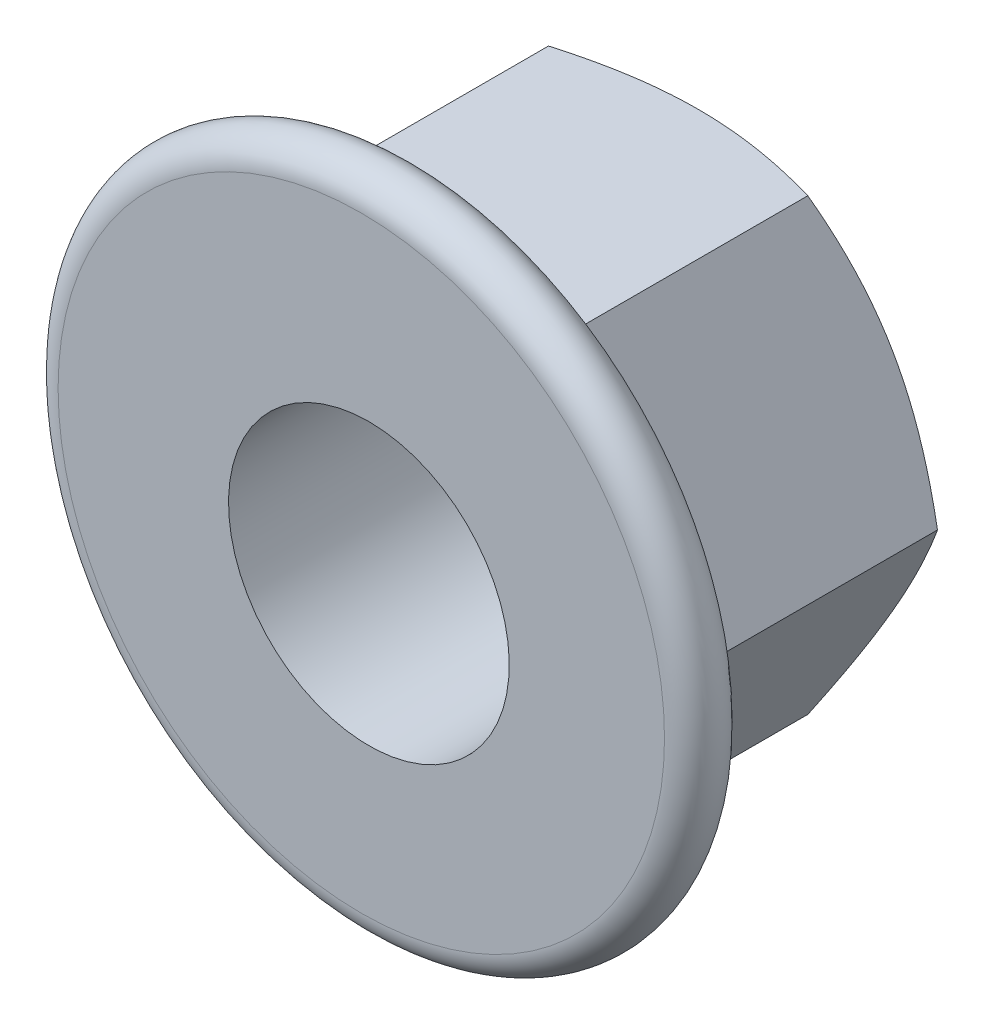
ISO-10303-21;
HEADER;
FILE_DESCRIPTION(('STEP AP214'),'2;1');
FILE_NAME('part.step','',(''),(''),'','','');
FILE_SCHEMA(('AUTOMOTIVE_DESIGN { 1 0 10303 214 1 1 1 1 }'));
ENDSEC;
DATA;
#1=APPLICATION_CONTEXT('core data for automotive mechanical design processes');
#2=APPLICATION_PROTOCOL_DEFINITION('international standard','automotive_design',2000,#1);
#3=PRODUCT_CONTEXT('',#1,'mechanical');
#4=PRODUCT('Part','Part','',(#3));
#5=PRODUCT_RELATED_PRODUCT_CATEGORY('part','',(#4));
#6=PRODUCT_DEFINITION_FORMATION('','',#4);
#7=PRODUCT_DEFINITION_CONTEXT('part definition',#1,'design');
#8=PRODUCT_DEFINITION('design','',#6,#7);
#9=PRODUCT_DEFINITION_SHAPE('','',#8);
#10=(LENGTH_UNIT() NAMED_UNIT(*) SI_UNIT(.MILLI.,.METRE.));
#11=(NAMED_UNIT(*) PLANE_ANGLE_UNIT() SI_UNIT($,.RADIAN.));
#12=(NAMED_UNIT(*) SI_UNIT($,.STERADIAN.) SOLID_ANGLE_UNIT());
#13=UNCERTAINTY_MEASURE_WITH_UNIT(LENGTH_MEASURE(1.E-05),#10,'distance_accuracy_value','');
#14=(GEOMETRIC_REPRESENTATION_CONTEXT(3) GLOBAL_UNCERTAINTY_ASSIGNED_CONTEXT((#13)) GLOBAL_UNIT_ASSIGNED_CONTEXT((#10,
#11,#12)) REPRESENTATION_CONTEXT('',''));
#15=CARTESIAN_POINT('',(0.,0.,0.));
#16=DIRECTION('',(0.,0.,1.));
#17=DIRECTION('',(1.,0.,0.));
#18=AXIS2_PLACEMENT_3D('',#15,#16,#17);
#19=CARTESIAN_POINT('',(0.,0.,-1.));
#20=DIRECTION('',(0.,0.,1.));
#21=DIRECTION('',(1.,0.,0.));
#22=AXIS2_PLACEMENT_3D('',#19,#20,#21);
#23=PLANE('',#22);
#24=CARTESIAN_POINT('',(32.1347700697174,-0.248725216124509,-0.999999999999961));
#25=DIRECTION('',(0.,0.,-1.));
#26=DIRECTION('',(0.,1.,0.));
#27=AXIS2_PLACEMENT_3D('',#24,#25,#26);
#28=CIRCLE('',#27,2.5);
#29=CARTESIAN_POINT('',(32.1347700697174,2.25127478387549,-0.999999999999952));
#30=VERTEX_POINT('',#29);
#31=EDGE_CURVE('E104',#30,#30,#28,.T.);
#32=ORIENTED_EDGE('',*,*,#31,.T.);
#33=EDGE_LOOP('',(#32));
#34=FACE_BOUND('',#33,.T.);
#35=CARTESIAN_POINT('',(32.,0.,-1.));
#36=DIRECTION('',(0.,0.,-1.));
#37=DIRECTION('',(0.,1.,0.));
#38=AXIS2_PLACEMENT_3D('',#35,#36,#37);
#39=CIRCLE('',#38,5.4);
#40=CARTESIAN_POINT('',(32.,5.4,-0.999999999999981));
#41=VERTEX_POINT('',#40);
#42=EDGE_CURVE('E9',#41,#41,#39,.T.);
#43=ORIENTED_EDGE('',*,*,#42,.F.);
#44=EDGE_LOOP('',(#43));
#45=FACE_BOUND('',#44,.T.);
#46=ADVANCED_FACE('F14',(#34,#45),#23,.T.);
#47=CARTESIAN_POINT('',(0.,0.,-7.));
#48=DIRECTION('',(0.,0.,-1.));
#49=DIRECTION('',(0.,1.,0.));
#50=AXIS2_PLACEMENT_3D('',#47,#48,#49);
#51=PLANE('',#50);
#52=CARTESIAN_POINT('',(32.1347700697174,-0.248725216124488,-7.));
#53=DIRECTION('',(0.,0.,-1.));
#54=DIRECTION('',(0.,1.,0.));
#55=AXIS2_PLACEMENT_3D('',#52,#53,#54);
#56=CIRCLE('',#55,2.5);
#57=CARTESIAN_POINT('',(32.1347700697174,2.25127478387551,-6.99999999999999));
#58=VERTEX_POINT('',#57);
#59=EDGE_CURVE('E258',#58,#58,#56,.T.);
#60=ORIENTED_EDGE('',*,*,#59,.F.);
#61=EDGE_LOOP('',(#60));
#62=FACE_BOUND('',#61,.T.);
#63=CARTESIAN_POINT('',(32.,0.,-7.));
#64=DIRECTION('',(0.,0.,-1.));
#65=DIRECTION('',(0.,1.,0.));
#66=AXIS2_PLACEMENT_3D('',#63,#64,#65);
#67=CIRCLE('',#66,4.);
#68=CARTESIAN_POINT('',(32.,4.,-7.));
#69=VERTEX_POINT('',#68);
#70=CARTESIAN_POINT('',(35.4641016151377,2.00000000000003,-7.));
#71=VERTEX_POINT('',#70);
#72=EDGE_CURVE('E263',#69,#71,#67,.T.);
#73=ORIENTED_EDGE('',*,*,#72,.T.);
#74=CARTESIAN_POINT('',(35.4641016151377,-1.99999999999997,-7.));
#75=VERTEX_POINT('',#74);
#76=EDGE_CURVE('E103',#71,#75,#67,.T.);
#77=ORIENTED_EDGE('',*,*,#76,.T.);
#78=CARTESIAN_POINT('',(32.,-4.,-7.));
#79=VERTEX_POINT('',#78);
#80=EDGE_CURVE('E273',#75,#79,#67,.T.);
#81=ORIENTED_EDGE('',*,*,#80,.T.);
#82=CARTESIAN_POINT('',(28.5358983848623,-1.99999999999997,-7.));
#83=VERTEX_POINT('',#82);
#84=EDGE_CURVE('E274',#79,#83,#67,.T.);
#85=ORIENTED_EDGE('',*,*,#84,.T.);
#86=CARTESIAN_POINT('',(28.5358983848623,2.00000000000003,-7.));
#87=VERTEX_POINT('',#86);
#88=EDGE_CURVE('E272',#83,#87,#67,.T.);
#89=ORIENTED_EDGE('',*,*,#88,.T.);
#90=EDGE_CURVE('E267',#87,#69,#67,.T.);
#91=ORIENTED_EDGE('',*,*,#90,.T.);
#92=EDGE_LOOP('',(#73,#77,#81,#85,#89,#91));
#93=FACE_BOUND('',#92,.T.);
#94=ADVANCED_FACE('F16',(#62,#93),#51,.T.);
#95=CARTESIAN_POINT('',(32.,0.,-3.09067784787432));
#96=DIRECTION('',(0.,0.,1.));
#97=DIRECTION('',(0.,-1.,0.));
#98=AXIS2_PLACEMENT_3D('',#95,#96,#97);
#99=CONICAL_SURFACE('',#98,4.,0.959931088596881);
#100=CARTESIAN_POINT('',(32.,0.,-1.9095760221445));
#101=DIRECTION('',(0.,0.,-1.));
#102=DIRECTION('',(0.,1.,0.));
#103=AXIS2_PLACEMENT_3D('',#100,#101,#102);
#104=CIRCLE('',#103,5.68678821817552);
#105=CARTESIAN_POINT('',(32.,5.68678821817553,-1.90957602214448));
#106=VERTEX_POINT('',#105);
#107=EDGE_CURVE('E22',#106,#106,#104,.T.);
#108=ORIENTED_EDGE('',*,*,#107,.T.);
#109=EDGE_LOOP('',(#108));
#110=FACE_BOUND('',#109,.T.);
#111=CARTESIAN_POINT('',(36.6189176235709,0.000200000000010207,-2.65730705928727));
#112=CARTESIAN_POINT('',(36.5154795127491,-0.178960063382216,-2.72977369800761));
#113=CARTESIAN_POINT('',(36.4106910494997,-0.360459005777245,-2.79584910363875));
#114=CARTESIAN_POINT('',(36.1983983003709,-0.728160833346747,-2.91101482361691));
#115=CARTESIAN_POINT('',(36.0908850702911,-0.914379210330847,-2.96003838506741));
#116=CARTESIAN_POINT('',(35.9301314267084,-1.19281268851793,-3.01652197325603));
#117=CARTESIAN_POINT('',(35.8776295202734,-1.28374865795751,-3.03235715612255));
#118=CARTESIAN_POINT('',(35.7722894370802,-1.46620303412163,-3.05854887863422));
#119=CARTESIAN_POINT('',(35.7194513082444,-1.5577213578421,-3.06890618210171));
#120=CARTESIAN_POINT('',(35.6136681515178,-1.74094315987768,-3.08382166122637));
#121=CARTESIAN_POINT('',(35.5607235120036,-1.83264596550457,-3.0883907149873));
#122=CARTESIAN_POINT('',(35.454795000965,-2.0161195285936,-3.09163055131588));
#123=CARTESIAN_POINT('',(35.4018111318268,-2.10789028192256,-3.09030166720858));
#124=CARTESIAN_POINT('',(35.2615700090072,-2.3507950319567,-3.07899371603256));
#125=CARTESIAN_POINT('',(35.174404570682,-2.50176999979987,-3.0639567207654));
#126=CARTESIAN_POINT('',(35.0009414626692,-2.80221691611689,-3.01904410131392));
#127=CARTESIAN_POINT('',(34.9146451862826,-2.95168645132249,-2.98914763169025));
#128=CARTESIAN_POINT('',(34.7407440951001,-3.25289197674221,-2.91545230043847));
#129=CARTESIAN_POINT('',(34.6531835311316,-3.40455132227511,-2.87124563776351));
#130=CARTESIAN_POINT('',(34.4799009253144,-3.70468559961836,-2.77187228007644));
#131=CARTESIAN_POINT('',(34.3941741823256,-3.85316867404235,-2.71673863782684));
#132=CARTESIAN_POINT('',(34.3092856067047,-4.0002,-2.65730705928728));
#133=B_SPLINE_CURVE_WITH_KNOTS('',3,(#111,#112,#113,#114,#115,#116,#117,#118,#119,#120,#121,
#122,#123,#124,#125,#126,#127,#128,#129,#130,#131,#132),.UNSPECIFIED.,.F.,.F.,(4,2,2,2,2,2,2,2,
2,2,4),(0.,0.658199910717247,1.31894822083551,1.63738904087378,1.95578544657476,
2.27358258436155,2.59136176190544,3.11554881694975,3.64047330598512,4.18191284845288,
4.72173893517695),.UNSPECIFIED.);
#134=CARTESIAN_POINT('',(36.618802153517,0.,-2.65738791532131));
#135=VERTEX_POINT('',#134);
#136=CARTESIAN_POINT('',(34.3094010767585,-4.,-2.65738791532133));
#137=VERTEX_POINT('',#136);
#138=EDGE_CURVE('E29',#135,#137,#133,.T.);
#139=ORIENTED_EDGE('',*,*,#138,.F.);
#140=CARTESIAN_POINT('',(34.3092856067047,4.0002,-2.65730705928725));
#141=CARTESIAN_POINT('',(34.4127237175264,3.82103993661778,-2.72977369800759));
#142=CARTESIAN_POINT('',(34.5175121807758,3.63954099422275,-2.79584910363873));
#143=CARTESIAN_POINT('',(34.7298049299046,3.27183916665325,-2.91101482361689));
#144=CARTESIAN_POINT('',(34.8373181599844,3.08562078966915,-2.96003838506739));
#145=CARTESIAN_POINT('',(34.9980718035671,2.80718731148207,-3.01652197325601));
#146=CARTESIAN_POINT('',(35.0505737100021,2.71625134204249,-3.03235715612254));
#147=CARTESIAN_POINT('',(35.1559137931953,2.53379696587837,-3.0585488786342));
#148=CARTESIAN_POINT('',(35.2087519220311,2.4422786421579,-3.06890618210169));
#149=CARTESIAN_POINT('',(35.3145350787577,2.25905684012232,-3.08382166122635));
#150=CARTESIAN_POINT('',(35.3674797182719,2.16735403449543,-3.08839071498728));
#151=CARTESIAN_POINT('',(35.4734082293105,1.9838804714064,-3.09163055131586));
#152=CARTESIAN_POINT('',(35.5263920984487,1.89210971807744,-3.09030166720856));
#153=CARTESIAN_POINT('',(35.6666332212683,1.6492049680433,-3.07899371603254));
#154=CARTESIAN_POINT('',(35.7537986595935,1.49823000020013,-3.06395672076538));
#155=CARTESIAN_POINT('',(35.9272617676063,1.19778308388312,-3.01904410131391));
#156=CARTESIAN_POINT('',(36.0135580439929,1.04831354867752,-2.98914763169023));
#157=CARTESIAN_POINT('',(36.1874591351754,0.7471080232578,-2.91545230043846));
#158=CARTESIAN_POINT('',(36.2750196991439,0.595448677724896,-2.8712456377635));
#159=CARTESIAN_POINT('',(36.4483023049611,0.295314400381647,-2.77187228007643));
#160=CARTESIAN_POINT('',(36.5340290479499,0.14683132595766,-2.71673863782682));
#161=CARTESIAN_POINT('',(36.6189176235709,-0.000199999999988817,-2.65730705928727));
#162=B_SPLINE_CURVE_WITH_KNOTS('',3,(#140,#141,#142,#143,#144,#145,#146,#147,#148,#149,#150,
#151,#152,#153,#154,#155,#156,#157,#158,#159,#160,#161),.UNSPECIFIED.,.F.,.F.,(4,2,2,2,2,2,2,2,
2,2,4),(0.,0.658199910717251,1.31894822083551,1.63738904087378,1.95578544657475,
2.27358258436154,2.59136176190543,3.11554881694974,3.64047330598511,4.18191284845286,
4.72173893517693),.UNSPECIFIED.);
#163=CARTESIAN_POINT('',(34.3094010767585,4.,-2.6573879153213));
#164=VERTEX_POINT('',#163);
#165=EDGE_CURVE('E90',#164,#135,#162,.T.);
#166=ORIENTED_EDGE('',*,*,#165,.F.);
#167=CARTESIAN_POINT('',(24.9229745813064,4.,-0.199363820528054));
#168=CARTESIAN_POINT('',(25.0639054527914,4.,-0.285264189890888));
#169=CARTESIAN_POINT('',(25.2051070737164,4.,-0.370723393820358));
#170=CARTESIAN_POINT('',(25.488152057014,4.,-0.540584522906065));
#171=CARTESIAN_POINT('',(25.6299954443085,4.,-0.624986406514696));
#172=CARTESIAN_POINT('',(25.9145609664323,4.,-0.792638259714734));
#173=CARTESIAN_POINT('',(26.057283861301,4.,-0.875886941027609));
#174=CARTESIAN_POINT('',(26.3435787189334,4.,-1.04090944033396));
#175=CARTESIAN_POINT('',(26.4871506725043,4.,-1.12268327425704));
#176=CARTESIAN_POINT('',(26.780013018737,4.,-1.28712522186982));
#177=CARTESIAN_POINT('',(26.929336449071,4.,-1.36973461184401));
#178=CARTESIAN_POINT('',(27.2292213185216,4.,-1.53267350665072));
#179=CARTESIAN_POINT('',(27.3797827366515,4.,-1.61300305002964));
#180=CARTESIAN_POINT('',(27.6823155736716,4.,-1.77084660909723));
#181=CARTESIAN_POINT('',(27.8342865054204,4.00000000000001,-1.84836155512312));
#182=CARTESIAN_POINT('',(28.1399361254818,4.,-1.99993727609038));
#183=CARTESIAN_POINT('',(28.2936147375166,4.,-2.07399820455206));
#184=CARTESIAN_POINT('',(28.6559618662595,4.,-2.24246527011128));
#185=CARTESIAN_POINT('',(28.8654384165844,4.,-2.33515270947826));
#186=CARTESIAN_POINT('',(29.2888282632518,4.00000000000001,-2.5100609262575));
#187=CARTESIAN_POINT('',(29.5027425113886,4.00000000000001,-2.59227943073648));
#188=CARTESIAN_POINT('',(29.9333427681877,4.00000000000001,-2.74162696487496));
#189=CARTESIAN_POINT('',(30.1499759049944,4.00000000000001,-2.80890570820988));
#190=CARTESIAN_POINT('',(30.5882183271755,4.00000000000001,-2.92473143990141));
#191=CARTESIAN_POINT('',(30.8098245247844,4.,-2.97328972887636));
#192=CARTESIAN_POINT('',(31.2086707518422,4.,-3.03888798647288));
#193=CARTESIAN_POINT('',(31.3851550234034,4.00000000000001,-3.06047029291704));
#194=CARTESIAN_POINT('',(31.7393586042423,4.00000000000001,-3.08744195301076));
#195=CARTESIAN_POINT('',(31.9170776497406,4.00000000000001,-3.09283466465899));
#196=CARTESIAN_POINT('',(32.272393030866,4.00000000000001,-3.08695020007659));
#197=CARTESIAN_POINT('',(32.4499891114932,4.00000000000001,-3.07565799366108));
#198=CARTESIAN_POINT('',(32.8034666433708,4.00000000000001,-3.03735634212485));
#199=CARTESIAN_POINT('',(32.979347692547,4.,-3.01034329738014));
#200=CARTESIAN_POINT('',(33.419041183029,4.,-2.92500955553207));
#201=CARTESIAN_POINT('',(33.6810987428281,4.00000000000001,-2.85771590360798));
#202=CARTESIAN_POINT('',(34.1980891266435,4.00000000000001,-2.69982509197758));
#203=CARTESIAN_POINT('',(34.453013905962,4.00000000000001,-2.60920270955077));
#204=CARTESIAN_POINT('',(34.9589048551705,4.00000000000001,-2.4107776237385));
#205=CARTESIAN_POINT('',(35.20980613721,4.00000000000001,-2.30281250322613));
#206=CARTESIAN_POINT('',(35.7061871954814,4.,-2.07549756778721));
#207=CARTESIAN_POINT('',(35.9516692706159,4.,-1.95615269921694));
#208=CARTESIAN_POINT('',(36.4442989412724,4.,-1.70650035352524));
#209=CARTESIAN_POINT('',(36.6913480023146,4.,-1.57600003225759));
#210=CARTESIAN_POINT('',(37.1821845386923,4.,-1.30896093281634));
#211=CARTESIAN_POINT('',(37.4259715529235,4.,-1.17242131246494));
#212=CARTESIAN_POINT('',(37.9053729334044,4.,-0.898149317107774));
#213=CARTESIAN_POINT('',(38.1410455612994,4.,-0.760518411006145));
#214=CARTESIAN_POINT('',(38.4930860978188,4.,-0.551705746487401));
#215=CARTESIAN_POINT('',(38.6101666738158,4.,-0.481720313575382));
#216=CARTESIAN_POINT('',(38.8439020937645,4.,-0.341046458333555));
#217=CARTESIAN_POINT('',(38.9605569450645,4.,-0.270358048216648));
#218=CARTESIAN_POINT('',(39.0770254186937,4.,-0.199363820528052));
#219=B_SPLINE_CURVE_WITH_KNOTS('',3,(#167,#168,#169,#170,#171,#172,#173,#174,#175,#176,#177,
#178,#179,#180,#181,#182,#183,#184,#185,#186,#187,#188,#189,#190,#191,#192,#193,#194,#195,#196,
#197,#198,#199,#200,#201,#202,#203,#204,#205,#206,#207,#208,#209,#210,#211,#212,#213,#214,#215,
#216,#217,#218),.UNSPECIFIED.,.F.,.F.,(4,2,2,2,2,2,2,2,2,2,2,2,2,2,2,2,2,2,2,2,2,2,2,2,2,4),(0.,
0.495141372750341,0.990302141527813,1.48597750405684,1.9816475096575,2.49358441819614,
3.00551266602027,3.51727013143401,4.02900482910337,4.7159938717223,5.40313181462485,
6.08303738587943,6.76253188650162,7.29526097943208,7.8278795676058,8.36097824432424,
8.89419903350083,9.7042502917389,10.5151810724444,11.3342040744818,12.1528726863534,
12.9909537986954,13.8291521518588,14.6478702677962,15.0570778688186,15.4662783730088),.UNSPECIFIED.);
#220=CARTESIAN_POINT('',(29.6905989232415,4.,-2.6573879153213));
#221=VERTEX_POINT('',#220);
#222=EDGE_CURVE('E85',#221,#164,#219,.T.);
#223=ORIENTED_EDGE('',*,*,#222,.F.);
#224=CARTESIAN_POINT('',(27.3810823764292,-0.000199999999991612,-2.65730705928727));
#225=CARTESIAN_POINT('',(27.4845204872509,0.178960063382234,-2.72977369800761));
#226=CARTESIAN_POINT('',(27.5893089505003,0.360459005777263,-2.79584910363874));
#227=CARTESIAN_POINT('',(27.8016016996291,0.728160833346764,-2.91101482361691));
#228=CARTESIAN_POINT('',(27.9091149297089,0.914379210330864,-2.9600383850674));
#229=CARTESIAN_POINT('',(28.0698685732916,1.19281268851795,-3.01652197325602));
#230=CARTESIAN_POINT('',(28.1223704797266,1.28374865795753,-3.03235715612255));
#231=CARTESIAN_POINT('',(28.2277105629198,1.46620303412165,-3.05854887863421));
#232=CARTESIAN_POINT('',(28.2805486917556,1.55772135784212,-3.0689061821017));
#233=CARTESIAN_POINT('',(28.3863318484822,1.7409431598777,-3.08382166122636));
#234=CARTESIAN_POINT('',(28.4392764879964,1.83264596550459,-3.08839071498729));
#235=CARTESIAN_POINT('',(28.545204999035,2.01611952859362,-3.09163055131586));
#236=CARTESIAN_POINT('',(28.5981888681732,2.10789028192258,-3.09030166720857));
#237=CARTESIAN_POINT('',(28.7384299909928,2.35079503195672,-3.07899371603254));
#238=CARTESIAN_POINT('',(28.825595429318,2.50176999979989,-3.06395672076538));
#239=CARTESIAN_POINT('',(28.9990585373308,2.8022169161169,-3.01904410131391));
#240=CARTESIAN_POINT('',(29.0853548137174,2.9516864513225,-2.98914763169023));
#241=CARTESIAN_POINT('',(29.2592559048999,3.25289197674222,-2.91545230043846));
#242=CARTESIAN_POINT('',(29.3468164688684,3.40455132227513,-2.87124563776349));
#243=CARTESIAN_POINT('',(29.5200990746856,3.70468559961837,-2.77187228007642));
#244=CARTESIAN_POINT('',(29.6058258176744,3.85316867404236,-2.71673863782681));
#245=CARTESIAN_POINT('',(29.6907143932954,4.0002,-2.65730705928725));
#246=B_SPLINE_CURVE_WITH_KNOTS('',3,(#224,#225,#226,#227,#228,#229,#230,#231,#232,#233,#234,
#235,#236,#237,#238,#239,#240,#241,#242,#243,#244,#245),.UNSPECIFIED.,.F.,.F.,(4,2,2,2,2,2,2,2,
2,2,4),(0.,0.658199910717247,1.31894822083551,1.63738904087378,1.95578544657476,
2.27358258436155,2.59136176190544,3.11554881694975,3.64047330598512,4.18191284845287,
4.72173893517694),.UNSPECIFIED.);
#247=CARTESIAN_POINT('',(27.381197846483,0.,-2.65738791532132));
#248=VERTEX_POINT('',#247);
#249=EDGE_CURVE('E88',#248,#221,#246,.T.);
#250=ORIENTED_EDGE('',*,*,#249,.F.);
#251=CARTESIAN_POINT('',(29.6907143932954,-4.0002,-2.65730705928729));
#252=CARTESIAN_POINT('',(29.5872762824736,-3.82103993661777,-2.72977369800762));
#253=CARTESIAN_POINT('',(29.4824878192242,-3.63954099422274,-2.79584910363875));
#254=CARTESIAN_POINT('',(29.2701950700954,-3.27183916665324,-2.91101482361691));
#255=CARTESIAN_POINT('',(29.1626818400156,-3.08562078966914,-2.96003838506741));
#256=CARTESIAN_POINT('',(29.0019281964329,-2.80718731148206,-3.01652197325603));
#257=CARTESIAN_POINT('',(28.9494262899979,-2.71625134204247,-3.03235715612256));
#258=CARTESIAN_POINT('',(28.8440862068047,-2.53379696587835,-3.05854887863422));
#259=CARTESIAN_POINT('',(28.7912480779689,-2.44227864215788,-3.06890618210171));
#260=CARTESIAN_POINT('',(28.6854649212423,-2.25905684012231,-3.08382166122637));
#261=CARTESIAN_POINT('',(28.6325202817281,-2.16735403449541,-3.08839071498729));
#262=CARTESIAN_POINT('',(28.5265917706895,-1.98388047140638,-3.09163055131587));
#263=CARTESIAN_POINT('',(28.4736079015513,-1.89210971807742,-3.09030166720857));
#264=CARTESIAN_POINT('',(28.3333667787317,-1.64920496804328,-3.07899371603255));
#265=CARTESIAN_POINT('',(28.2462013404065,-1.49823000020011,-3.06395672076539));
#266=CARTESIAN_POINT('',(28.0727382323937,-1.1977830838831,-3.01904410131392));
#267=CARTESIAN_POINT('',(27.9864419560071,-1.04831354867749,-2.98914763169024));
#268=CARTESIAN_POINT('',(27.8125408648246,-0.747108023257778,-2.91545230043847));
#269=CARTESIAN_POINT('',(27.7249803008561,-0.595448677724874,-2.8712456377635));
#270=CARTESIAN_POINT('',(27.5516976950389,-0.295314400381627,-2.77187228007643));
#271=CARTESIAN_POINT('',(27.4659709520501,-0.146831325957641,-2.71673863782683));
#272=CARTESIAN_POINT('',(27.3810823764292,0.000200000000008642,-2.65730705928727));
#273=B_SPLINE_CURVE_WITH_KNOTS('',3,(#251,#252,#253,#254,#255,#256,#257,#258,#259,#260,#261,
#262,#263,#264,#265,#266,#267,#268,#269,#270,#271,#272),.UNSPECIFIED.,.F.,.F.,(4,2,2,2,2,2,2,2,
2,2,4),(0.,0.658199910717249,1.31894822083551,1.63738904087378,1.95578544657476,
2.27358258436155,2.59136176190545,3.11554881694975,3.64047330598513,4.18191284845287,
4.72173893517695),.UNSPECIFIED.);
#274=CARTESIAN_POINT('',(29.6905989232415,-4.,-2.65738791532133));
#275=VERTEX_POINT('',#274);
#276=EDGE_CURVE('E37',#275,#248,#273,.T.);
#277=ORIENTED_EDGE('',*,*,#276,.F.);
#278=CARTESIAN_POINT('',(39.0770254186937,-4.,-0.199363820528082));
#279=CARTESIAN_POINT('',(38.9360945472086,-4.,-0.285264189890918));
#280=CARTESIAN_POINT('',(38.7948929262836,-4.,-0.370723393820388));
#281=CARTESIAN_POINT('',(38.511847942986,-4.,-0.540584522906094));
#282=CARTESIAN_POINT('',(38.3700045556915,-4.,-0.624986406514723));
#283=CARTESIAN_POINT('',(38.0854390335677,-4.,-0.79263825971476));
#284=CARTESIAN_POINT('',(37.942716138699,-4.,-0.875886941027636));
#285=CARTESIAN_POINT('',(37.6564212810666,-4.,-1.04090944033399));
#286=CARTESIAN_POINT('',(37.5128493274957,-4.,-1.12268327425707));
#287=CARTESIAN_POINT('',(37.219986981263,-4.,-1.28712522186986));
#288=CARTESIAN_POINT('',(37.070663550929,-4.,-1.36973461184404));
#289=CARTESIAN_POINT('',(36.7707786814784,-4.,-1.53267350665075));
#290=CARTESIAN_POINT('',(36.6202172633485,-4.,-1.61300305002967));
#291=CARTESIAN_POINT('',(36.3176844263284,-4.,-1.77084660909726));
#292=CARTESIAN_POINT('',(36.1657134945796,-3.99999999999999,-1.84836155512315));
#293=CARTESIAN_POINT('',(35.8600638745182,-4.,-1.99993727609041));
#294=CARTESIAN_POINT('',(35.7063852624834,-4.,-2.07399820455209));
#295=CARTESIAN_POINT('',(35.3440381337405,-4.,-2.24246527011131));
#296=CARTESIAN_POINT('',(35.1345615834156,-4.,-2.33515270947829));
#297=CARTESIAN_POINT('',(34.7111717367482,-3.99999999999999,-2.51006092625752));
#298=CARTESIAN_POINT('',(34.4972574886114,-3.99999999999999,-2.59227943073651));
#299=CARTESIAN_POINT('',(34.0666572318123,-3.99999999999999,-2.74162696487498));
#300=CARTESIAN_POINT('',(33.8500240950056,-3.99999999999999,-2.8089057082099));
#301=CARTESIAN_POINT('',(33.4117816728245,-3.99999999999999,-2.92473143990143));
#302=CARTESIAN_POINT('',(33.1901754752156,-4.,-2.97328972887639));
#303=CARTESIAN_POINT('',(32.7913292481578,-4.,-3.03888798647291));
#304=CARTESIAN_POINT('',(32.6148449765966,-3.99999999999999,-3.06047029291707));
#305=CARTESIAN_POINT('',(32.2606413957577,-3.99999999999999,-3.08744195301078));
#306=CARTESIAN_POINT('',(32.0829223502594,-3.99999999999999,-3.09283466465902));
#307=CARTESIAN_POINT('',(31.727606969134,-3.99999999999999,-3.08695020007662));
#308=CARTESIAN_POINT('',(31.5500108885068,-3.99999999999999,-3.0756579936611));
#309=CARTESIAN_POINT('',(31.1965333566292,-3.99999999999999,-3.03735634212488));
#310=CARTESIAN_POINT('',(31.0206523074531,-4.,-3.01034329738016));
#311=CARTESIAN_POINT('',(30.580958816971,-4.,-2.9250095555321));
#312=CARTESIAN_POINT('',(30.3189012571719,-3.99999999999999,-2.857715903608));
#313=CARTESIAN_POINT('',(29.8019108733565,-3.99999999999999,-2.6998250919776));
#314=CARTESIAN_POINT('',(29.546986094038,-3.99999999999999,-2.60920270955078));
#315=CARTESIAN_POINT('',(29.0410951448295,-3.99999999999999,-2.41077762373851));
#316=CARTESIAN_POINT('',(28.79019386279,-3.99999999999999,-2.30281250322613));
#317=CARTESIAN_POINT('',(28.2938128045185,-4.,-2.07549756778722));
#318=CARTESIAN_POINT('',(28.0483307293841,-4.,-1.95615269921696));
#319=CARTESIAN_POINT('',(27.5557010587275,-4.,-1.70650035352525));
#320=CARTESIAN_POINT('',(27.3086519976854,-4.,-1.5760000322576));
#321=CARTESIAN_POINT('',(26.8178154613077,-4.,-1.30896093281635));
#322=CARTESIAN_POINT('',(26.5740284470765,-4.,-1.17242131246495));
#323=CARTESIAN_POINT('',(26.0946270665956,-4.,-0.898149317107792));
#324=CARTESIAN_POINT('',(25.8589544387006,-4.,-0.760518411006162));
#325=CARTESIAN_POINT('',(25.5069139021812,-4.,-0.551705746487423));
#326=CARTESIAN_POINT('',(25.3898333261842,-4.,-0.481720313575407));
#327=CARTESIAN_POINT('',(25.1560979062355,-4.,-0.341046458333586));
#328=CARTESIAN_POINT('',(25.0394430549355,-4.,-0.27035804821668));
#329=CARTESIAN_POINT('',(24.9229745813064,-4.,-0.199363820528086));
#330=B_SPLINE_CURVE_WITH_KNOTS('',3,(#278,#279,#280,#281,#282,#283,#284,#285,#286,#287,#288,
#289,#290,#291,#292,#293,#294,#295,#296,#297,#298,#299,#300,#301,#302,#303,#304,#305,#306,#307,
#308,#309,#310,#311,#312,#313,#314,#315,#316,#317,#318,#319,#320,#321,#322,#323,#324,#325,#326,
#327,#328,#329),.UNSPECIFIED.,.F.,.F.,(4,2,2,2,2,2,2,2,2,2,2,2,2,2,2,2,2,2,2,2,2,2,2,2,2,4),(0.,
0.495141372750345,0.990302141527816,1.48597750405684,1.9816475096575,2.49358441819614,
3.00551266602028,3.51727013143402,4.02900482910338,4.71599387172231,5.40313181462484,
6.08303738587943,6.76253188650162,7.29526097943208,7.8278795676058,8.36097824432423,
8.89419903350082,9.70425029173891,10.5151810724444,11.3342040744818,12.1528726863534,
12.9909537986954,13.8291521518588,14.6478702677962,15.0570778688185,15.4662783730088),.UNSPECIFIED.);
#331=EDGE_CURVE('E95',#137,#275,#330,.T.);
#332=ORIENTED_EDGE('',*,*,#331,.F.);
#333=EDGE_LOOP('',(#139,#166,#223,#250,#277,#332));
#334=FACE_BOUND('',#333,.T.);
#335=ADVANCED_FACE('F87',(#110,#334),#99,.T.);
#336=CARTESIAN_POINT('',(32.,0.,-1.5));
#337=DIRECTION('',(0.,0.,-1.));
#338=DIRECTION('',(0.,1.,0.));
#339=AXIS2_PLACEMENT_3D('',#336,#337,#338);
#340=TOROIDAL_SURFACE('',#339,5.4,0.499999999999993);
#341=ORIENTED_EDGE('',*,*,#42,.T.);
#342=EDGE_LOOP('',(#341));
#343=FACE_BOUND('',#342,.T.);
#344=ORIENTED_EDGE('',*,*,#107,.F.);
#345=EDGE_LOOP('',(#344));
#346=FACE_BOUND('',#345,.T.);
#347=ADVANCED_FACE('F144',(#343,#346),#340,.T.);
#348=CARTESIAN_POINT('',(36.618802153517,0.,-13.5));
#349=DIRECTION('',(-0.866025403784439,0.5,0.));
#350=DIRECTION('',(-0.5,-0.866025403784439,0.));
#351=AXIS2_PLACEMENT_3D('',#348,#349,#350);
#352=PLANE('',#351);
#353=DIRECTION('',(0.,0.,1.));
#354=VECTOR('',#353,1.);
#355=CARTESIAN_POINT('',(36.618802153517,0.,-13.5));
#356=LINE('',#355,#354);
#357=CARTESIAN_POINT('',(36.618802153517,0.,-6.64273441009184));
#358=VERTEX_POINT('',#357);
#359=EDGE_CURVE('E112',#358,#135,#356,.T.);
#360=ORIENTED_EDGE('',*,*,#359,.T.);
#361=ORIENTED_EDGE('',*,*,#138,.T.);
#362=DIRECTION('',(0.,0.,1.));
#363=VECTOR('',#362,1.);
#364=CARTESIAN_POINT('',(34.3094010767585,-3.99999999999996,-13.5));
#365=LINE('',#364,#363);
#366=CARTESIAN_POINT('',(34.3094010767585,-4.,-6.64273441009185));
#367=VERTEX_POINT('',#366);
#368=EDGE_CURVE('E118',#367,#137,#365,.T.);
#369=ORIENTED_EDGE('',*,*,#368,.F.);
#370=CARTESIAN_POINT('',(34.3092856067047,-4.0002,-6.64266774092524));
#371=CARTESIAN_POINT('',(34.4107717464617,-3.82442084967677,-6.70128212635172));
#372=CARTESIAN_POINT('',(34.513133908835,-3.64712438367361,-6.75458967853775));
#373=CARTESIAN_POINT('',(34.7196307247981,-3.28946140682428,-6.84763832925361));
#374=CARTESIAN_POINT('',(34.823769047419,-3.10908854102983,-6.88734651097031));
#375=CARTESIAN_POINT('',(35.0307551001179,-2.75057818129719,-6.94915778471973));
#376=CARTESIAN_POINT('',(35.1335709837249,-2.57249584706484,-6.97167226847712));
#377=CARTESIAN_POINT('',(35.3396865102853,-2.21549328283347,-6.99854937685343));
#378=CARTESIAN_POINT('',(35.4429854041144,-2.03657435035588,-7.00293425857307));
#379=CARTESIAN_POINT('',(35.6360035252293,-1.70225715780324,-6.99380992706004));
#380=CARTESIAN_POINT('',(35.7257516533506,-1.54680884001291,-6.98254104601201));
#381=CARTESIAN_POINT('',(35.9046632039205,-1.23692494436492,-6.94682600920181));
#382=CARTESIAN_POINT('',(35.9938260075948,-1.08249043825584,-6.92236765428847));
#383=CARTESIAN_POINT('',(36.173106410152,-0.771967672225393,-6.86122393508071));
#384=CARTESIAN_POINT('',(36.2632013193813,-0.615918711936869,-6.82427939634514));
#385=CARTESIAN_POINT('',(36.4420474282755,-0.306148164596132,-6.74042992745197));
#386=CARTESIAN_POINT('',(36.5308009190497,-0.152422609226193,-6.69354469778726));
#387=CARTESIAN_POINT('',(36.6189176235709,0.000200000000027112,-6.64266774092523));
#388=B_SPLINE_CURVE_WITH_KNOTS('',3,(#370,#371,#372,#373,#374,#375,#376,#377,#378,#379,#380,
#381,#382,#383,#384,#385,#386,#387),.UNSPECIFIED.,.F.,.F.,(4,2,2,2,2,2,2,2,4),(0.,
0.634047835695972,1.26961969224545,1.88946157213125,2.508542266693,3.04757825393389,
3.58711366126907,4.13861653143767,4.68903648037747),.UNSPECIFIED.);
#389=EDGE_CURVE('E225',#367,#75,#388,.T.);
#390=ORIENTED_EDGE('',*,*,#389,.T.);
#391=EDGE_CURVE('E193',#75,#358,#388,.T.);
#392=ORIENTED_EDGE('',*,*,#391,.T.);
#393=EDGE_LOOP('',(#360,#361,#369,#390,#392));
#394=FACE_BOUND('',#393,.T.);
#395=ADVANCED_FACE('F137',(#394),#352,.F.);
#396=CARTESIAN_POINT('',(27.381197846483,0.,-13.5));
#397=DIRECTION('',(0.866025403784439,-0.5,0.));
#398=DIRECTION('',(0.5,0.866025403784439,0.));
#399=AXIS2_PLACEMENT_3D('',#396,#397,#398);
#400=PLANE('',#399);
#401=DIRECTION('',(0.,0.,1.));
#402=VECTOR('',#401,1.);
#403=CARTESIAN_POINT('',(27.381197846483,0.,-13.5));
#404=LINE('',#403,#402);
#405=CARTESIAN_POINT('',(27.381197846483,0.,-6.64273441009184));
#406=VERTEX_POINT('',#405);
#407=EDGE_CURVE('E102',#406,#248,#404,.T.);
#408=ORIENTED_EDGE('',*,*,#407,.T.);
#409=ORIENTED_EDGE('',*,*,#249,.T.);
#410=DIRECTION('',(0.,0.,1.));
#411=VECTOR('',#410,1.);
#412=CARTESIAN_POINT('',(29.6905989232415,4.00000000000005,-13.5));
#413=LINE('',#412,#411);
#414=CARTESIAN_POINT('',(29.6905989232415,4.,-6.64273441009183));
#415=VERTEX_POINT('',#414);
#416=EDGE_CURVE('E100',#415,#221,#413,.T.);
#417=ORIENTED_EDGE('',*,*,#416,.F.);
#418=CARTESIAN_POINT('',(29.6907143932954,4.0002,-6.64266774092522));
#419=CARTESIAN_POINT('',(29.5892282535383,3.82442084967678,-6.70128212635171));
#420=CARTESIAN_POINT('',(29.486866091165,3.64712438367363,-6.75458967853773));
#421=CARTESIAN_POINT('',(29.2803692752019,3.28946140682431,-6.84763832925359));
#422=CARTESIAN_POINT('',(29.176230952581,3.10908854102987,-6.88734651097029));
#423=CARTESIAN_POINT('',(28.9692448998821,2.75057818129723,-6.94915778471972));
#424=CARTESIAN_POINT('',(28.8664290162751,2.57249584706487,-6.97167226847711));
#425=CARTESIAN_POINT('',(28.6603134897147,2.21549328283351,-6.99854937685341));
#426=CARTESIAN_POINT('',(28.5570145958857,2.03657435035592,-7.00293425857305));
#427=CARTESIAN_POINT('',(28.3639964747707,1.70225715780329,-6.99380992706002));
#428=CARTESIAN_POINT('',(28.2742483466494,1.54680884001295,-6.982541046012));
#429=CARTESIAN_POINT('',(28.0953367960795,1.23692494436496,-6.94682600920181));
#430=CARTESIAN_POINT('',(28.0061739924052,1.08249043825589,-6.92236765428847));
#431=CARTESIAN_POINT('',(27.826893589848,0.771967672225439,-6.86122393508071));
#432=CARTESIAN_POINT('',(27.7367986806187,0.615918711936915,-6.82427939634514));
#433=CARTESIAN_POINT('',(27.5579525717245,0.306148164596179,-6.74042992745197));
#434=CARTESIAN_POINT('',(27.4691990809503,0.15242260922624,-6.69354469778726));
#435=CARTESIAN_POINT('',(27.3810823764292,-0.000199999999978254,-6.64266774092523));
#436=B_SPLINE_CURVE_WITH_KNOTS('',3,(#418,#419,#420,#421,#422,#423,#424,#425,#426,#427,#428,
#429,#430,#431,#432,#433,#434,#435),.UNSPECIFIED.,.F.,.F.,(4,2,2,2,2,2,2,2,4),(0.,
0.634047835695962,1.26961969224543,1.88946157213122,2.50854226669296,3.04757825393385,
3.58711366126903,4.13861653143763,4.68903648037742),.UNSPECIFIED.);
#437=EDGE_CURVE('E282',#415,#87,#436,.T.);
#438=ORIENTED_EDGE('',*,*,#437,.T.);
#439=EDGE_CURVE('E123',#87,#406,#436,.T.);
#440=ORIENTED_EDGE('',*,*,#439,.T.);
#441=EDGE_LOOP('',(#408,#409,#417,#438,#440));
#442=FACE_BOUND('',#441,.T.);
#443=ADVANCED_FACE('F99',(#442),#400,.F.);
#444=CARTESIAN_POINT('',(29.6905989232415,4.00000000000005,-13.5));
#445=DIRECTION('',(0.,-1.,0.));
#446=DIRECTION('',(1.,0.,0.));
#447=AXIS2_PLACEMENT_3D('',#444,#445,#446);
#448=PLANE('',#447);
#449=ORIENTED_EDGE('',*,*,#416,.T.);
#450=ORIENTED_EDGE('',*,*,#222,.T.);
#451=DIRECTION('',(0.,0.,1.));
#452=VECTOR('',#451,1.);
#453=CARTESIAN_POINT('',(34.3094010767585,4.00000000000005,-13.5));
#454=LINE('',#453,#452);
#455=CARTESIAN_POINT('',(34.3094010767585,4.,-6.64273441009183));
#456=VERTEX_POINT('',#455);
#457=EDGE_CURVE('E109',#456,#164,#454,.T.);
#458=ORIENTED_EDGE('',*,*,#457,.F.);
#459=CARTESIAN_POINT('',(38.9514397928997,4.,-4.67897578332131));
#460=CARTESIAN_POINT('',(38.7851129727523,4.00000000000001,-4.76219567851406));
#461=CARTESIAN_POINT('',(38.6184963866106,4.00000000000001,-4.84484250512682));
#462=CARTESIAN_POINT('',(38.2845515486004,4.00000000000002,-5.00871300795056));
#463=CARTESIAN_POINT('',(38.1172232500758,4.00000000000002,-5.08993658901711));
#464=CARTESIAN_POINT('',(37.7814075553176,4.00000000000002,-5.25083409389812));
#465=CARTESIAN_POINT('',(37.6129185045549,4.00000000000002,-5.33050457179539));
#466=CARTESIAN_POINT('',(37.2749640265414,4.00000000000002,-5.48774234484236));
#467=CARTESIAN_POINT('',(37.1054986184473,4.00000000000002,-5.56530968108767));
#468=CARTESIAN_POINT('',(36.757736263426,4.00000000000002,-5.72129456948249));
#469=CARTESIAN_POINT('',(36.5793856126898,4.00000000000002,-5.79959278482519));
#470=CARTESIAN_POINT('',(36.2211655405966,4.00000000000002,-5.95263087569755));
#471=CARTESIAN_POINT('',(36.0412961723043,4.00000000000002,-6.02737087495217));
#472=CARTESIAN_POINT('',(35.6798413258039,4.00000000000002,-6.17229415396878));
#473=CARTESIAN_POINT('',(35.4982569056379,4.00000000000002,-6.24248005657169));
#474=CARTESIAN_POINT('',(35.1329668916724,4.00000000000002,-6.37706855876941));
#475=CARTESIAN_POINT('',(34.9492615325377,4.,-6.4414717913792));
#476=CARTESIAN_POINT('',(34.5361707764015,4.,-6.57707212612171));
#477=CARTESIAN_POINT('',(34.3061423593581,4.00000000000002,-6.64633998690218));
#478=CARTESIAN_POINT('',(33.8419360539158,4.00000000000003,-6.76968872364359));
#479=CARTESIAN_POINT('',(33.607758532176,4.00000000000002,-6.8237709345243));
#480=CARTESIAN_POINT('',(33.2557140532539,4.00000000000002,-6.8897069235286));
#481=CARTESIAN_POINT('',(33.1392373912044,4.00000000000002,-6.90905154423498));
#482=CARTESIAN_POINT('',(32.9055360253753,4.00000000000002,-6.9424628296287));
#483=CARTESIAN_POINT('',(32.7883114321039,4.00000000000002,-6.95653025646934));
#484=CARTESIAN_POINT('',(32.5533480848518,4.00000000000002,-6.97896643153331));
#485=CARTESIAN_POINT('',(32.4356094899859,4.00000000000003,-6.98733683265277));
#486=CARTESIAN_POINT('',(32.1998575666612,4.00000000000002,-6.99811453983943));
#487=CARTESIAN_POINT('',(32.0818442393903,4.,-7.00052187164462));
#488=CARTESIAN_POINT('',(31.8451319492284,4.,-6.99928572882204));
#489=CARTESIAN_POINT('',(31.7264331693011,4.00000000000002,-6.99560546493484));
#490=CARTESIAN_POINT('',(31.4893823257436,4.00000000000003,-6.98225765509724));
#491=CARTESIAN_POINT('',(31.3710302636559,4.00000000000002,-6.97259008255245));
#492=CARTESIAN_POINT('',(31.0168165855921,4.00000000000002,-6.93502969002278));
#493=CARTESIAN_POINT('',(30.7818329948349,4.00000000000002,-6.8985795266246));
#494=CARTESIAN_POINT('',(30.3117541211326,4.00000000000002,-6.8060521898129));
#495=CARTESIAN_POINT('',(30.0767255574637,4.00000000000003,-6.74965024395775));
#496=CARTESIAN_POINT('',(29.6106795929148,4.00000000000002,-6.62197888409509));
#497=CARTESIAN_POINT('',(29.3796645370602,4.,-6.55070107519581));
#498=CARTESIAN_POINT('',(28.9696086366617,4.,-6.41333468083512));
#499=CARTESIAN_POINT('',(28.7898625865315,4.00000000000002,-6.34931157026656));
#500=CARTESIAN_POINT('',(28.4324311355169,4.00000000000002,-6.21591581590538));
#501=CARTESIAN_POINT('',(28.2547451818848,4.00000000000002,-6.14654464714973));
#502=CARTESIAN_POINT('',(27.9009643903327,4.00000000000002,-6.00354067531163));
#503=CARTESIAN_POINT('',(27.7248707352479,4.00000000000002,-5.92990496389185));
#504=CARTESIAN_POINT('',(27.3741176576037,4.00000000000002,-5.77929016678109));
#505=CARTESIAN_POINT('',(27.1994582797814,4.00000000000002,-5.70231097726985));
#506=CARTESIAN_POINT('',(26.8587234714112,4.00000000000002,-5.54900114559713));
#507=CARTESIAN_POINT('',(26.6925980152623,4.00000000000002,-5.47278133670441));
#508=CARTESIAN_POINT('',(26.3612826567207,4.00000000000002,-5.31834495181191));
#509=CARTESIAN_POINT('',(26.1960927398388,4.00000000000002,-5.24012840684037));
#510=CARTESIAN_POINT('',(25.8667954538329,4.00000000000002,-5.08219581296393));
#511=CARTESIAN_POINT('',(25.7026866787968,4.00000000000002,-5.00248268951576));
#512=CARTESIAN_POINT('',(25.3751456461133,4.00000000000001,-4.84168903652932));
#513=CARTESIAN_POINT('',(25.2117133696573,4.00000000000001,-4.76060854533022));
#514=CARTESIAN_POINT('',(25.0485602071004,4.,-4.67897578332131));
#515=B_SPLINE_CURVE_WITH_KNOTS('',3,(#459,#460,#461,#462,#463,#464,#465,#466,#467,#468,#469,
#470,#471,#472,#473,#474,#475,#476,#477,#478,#479,#480,#481,#482,#483,#484,#485,#486,#487,#488,
#489,#490,#491,#492,#493,#494,#495,#496,#497,#498,#499,#500,#501,#502,#503,#504,#505,#506,#507,
#508,#509,#510,#511,#512,#513,#514),.UNSPECIFIED.,.F.,.F.,(4,2,2,2,2,2,2,2,2,2,2,2,2,2,2,2,2,2,
2,2,2,2,2,2,2,2,2,4),(0.,0.557955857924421,1.11594887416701,1.67506433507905,2.23416886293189,
2.81848070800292,3.40277222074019,3.98672417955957,4.57061213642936,5.29094322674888,
6.0112109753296,6.36532658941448,6.719391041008,7.07335272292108,7.42731287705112,
7.78341994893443,8.13952860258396,8.85185199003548,9.57634870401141,10.301255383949,
10.8735847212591,11.4457567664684,12.018323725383,12.5909084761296,13.1392213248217,
13.6875256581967,14.2348513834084,14.7821617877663),.UNSPECIFIED.);
#516=EDGE_CURVE('E191',#456,#69,#515,.T.);
#517=ORIENTED_EDGE('',*,*,#516,.T.);
#518=EDGE_CURVE('E108',#69,#415,#515,.T.);
#519=ORIENTED_EDGE('',*,*,#518,.T.);
#520=EDGE_LOOP('',(#449,#450,#458,#517,#519));
#521=FACE_BOUND('',#520,.T.);
#522=ADVANCED_FACE('F106',(#521),#448,.F.);
#523=CARTESIAN_POINT('',(32.,0.,-7.));
#524=DIRECTION('',(0.,0.,1.));
#525=DIRECTION('',(0.,-1.,0.));
#526=AXIS2_PLACEMENT_3D('',#523,#524,#525);
#527=CONICAL_SURFACE('',#526,4.,1.0471975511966);
#528=ORIENTED_EDGE('',*,*,#518,.F.);
#529=ORIENTED_EDGE('',*,*,#90,.F.);
#530=ORIENTED_EDGE('',*,*,#437,.F.);
#531=EDGE_LOOP('',(#528,#529,#530));
#532=FACE_BOUND('',#531,.T.);
#533=ADVANCED_FACE('F203',(#532),#527,.T.);
#534=CARTESIAN_POINT('',(29.6905989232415,-3.99999999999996,-13.5));
#535=DIRECTION('',(0.866025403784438,0.5,0.));
#536=DIRECTION('',(-0.5,0.866025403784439,0.));
#537=AXIS2_PLACEMENT_3D('',#534,#535,#536);
#538=PLANE('',#537);
#539=DIRECTION('',(0.,0.,1.));
#540=VECTOR('',#539,1.);
#541=CARTESIAN_POINT('',(29.6905989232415,-3.99999999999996,-13.5));
#542=LINE('',#541,#540);
#543=CARTESIAN_POINT('',(29.6905989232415,-4.,-6.64273441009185));
#544=VERTEX_POINT('',#543);
#545=EDGE_CURVE('E121',#544,#275,#542,.T.);
#546=ORIENTED_EDGE('',*,*,#545,.T.);
#547=ORIENTED_EDGE('',*,*,#276,.T.);
#548=ORIENTED_EDGE('',*,*,#407,.F.);
#549=CARTESIAN_POINT('',(27.3810823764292,0.000200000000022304,-6.64266774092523));
#550=CARTESIAN_POINT('',(27.4825685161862,-0.175579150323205,-6.70128212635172));
#551=CARTESIAN_POINT('',(27.5849306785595,-0.352875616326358,-6.75458967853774));
#552=CARTESIAN_POINT('',(27.7914274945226,-0.710538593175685,-6.8476383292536));
#553=CARTESIAN_POINT('',(27.8955658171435,-0.89091145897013,-6.8873465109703));
#554=CARTESIAN_POINT('',(28.1025518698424,-1.24942181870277,-6.94915778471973));
#555=CARTESIAN_POINT('',(28.2053677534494,-1.42750415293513,-6.97167226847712));
#556=CARTESIAN_POINT('',(28.4114832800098,-1.78450671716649,-6.99854937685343));
#557=CARTESIAN_POINT('',(28.5147821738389,-1.96342564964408,-7.00293425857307));
#558=CARTESIAN_POINT('',(28.7078002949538,-2.29774284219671,-6.99380992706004));
#559=CARTESIAN_POINT('',(28.7975484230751,-2.45319115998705,-6.98254104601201));
#560=CARTESIAN_POINT('',(28.976459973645,-2.76307505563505,-6.94682600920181));
#561=CARTESIAN_POINT('',(29.0656227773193,-2.91750956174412,-6.92236765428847));
#562=CARTESIAN_POINT('',(29.2449031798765,-3.22803232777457,-6.86122393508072));
#563=CARTESIAN_POINT('',(29.3349980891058,-3.3840812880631,-6.82427939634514));
#564=CARTESIAN_POINT('',(29.513844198,-3.69385183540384,-6.74042992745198));
#565=CARTESIAN_POINT('',(29.6025976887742,-3.84757739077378,-6.69354469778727));
#566=CARTESIAN_POINT('',(29.6907143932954,-4.0002,-6.64266774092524));
#567=B_SPLINE_CURVE_WITH_KNOTS('',3,(#549,#550,#551,#552,#553,#554,#555,#556,#557,#558,#559,
#560,#561,#562,#563,#564,#565,#566),.UNSPECIFIED.,.F.,.F.,(4,2,2,2,2,2,2,2,4),(0.,
0.634047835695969,1.26961969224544,1.88946157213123,2.50854226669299,3.04757825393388,
3.58711366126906,4.13861653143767,4.68903648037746),.UNSPECIFIED.);
#568=EDGE_CURVE('E271',#406,#83,#567,.T.);
#569=ORIENTED_EDGE('',*,*,#568,.T.);
#570=EDGE_CURVE('E227',#83,#544,#567,.T.);
#571=ORIENTED_EDGE('',*,*,#570,.T.);
#572=EDGE_LOOP('',(#546,#547,#548,#569,#571));
#573=FACE_BOUND('',#572,.T.);
#574=ADVANCED_FACE('F146',(#573),#538,.F.);
#575=ORIENTED_EDGE('',*,*,#568,.F.);
#576=ORIENTED_EDGE('',*,*,#439,.F.);
#577=ORIENTED_EDGE('',*,*,#88,.F.);
#578=EDGE_LOOP('',(#575,#576,#577));
#579=FACE_BOUND('',#578,.T.);
#580=ADVANCED_FACE('F178',(#579),#527,.T.);
#581=CARTESIAN_POINT('',(34.3094010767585,4.00000000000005,-13.5));
#582=DIRECTION('',(-0.866025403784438,-0.5,0.));
#583=DIRECTION('',(0.5,-0.866025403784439,0.));
#584=AXIS2_PLACEMENT_3D('',#581,#582,#583);
#585=PLANE('',#584);
#586=ORIENTED_EDGE('',*,*,#457,.T.);
#587=ORIENTED_EDGE('',*,*,#165,.T.);
#588=ORIENTED_EDGE('',*,*,#359,.F.);
#589=CARTESIAN_POINT('',(36.6189176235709,-0.000199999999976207,-6.64266774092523));
#590=CARTESIAN_POINT('',(36.5174314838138,0.175579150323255,-6.70128212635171));
#591=CARTESIAN_POINT('',(36.4150693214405,0.352875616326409,-6.75458967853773));
#592=CARTESIAN_POINT('',(36.2085725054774,0.710538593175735,-6.84763832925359));
#593=CARTESIAN_POINT('',(36.1044341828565,0.89091145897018,-6.88734651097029));
#594=CARTESIAN_POINT('',(35.8974481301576,1.24942181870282,-6.94915778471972));
#595=CARTESIAN_POINT('',(35.7946322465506,1.42750415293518,-6.97167226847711));
#596=CARTESIAN_POINT('',(35.5885167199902,1.78450671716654,-6.99854937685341));
#597=CARTESIAN_POINT('',(35.4852178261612,1.96342564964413,-7.00293425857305));
#598=CARTESIAN_POINT('',(35.2921997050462,2.29774284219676,-6.99380992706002));
#599=CARTESIAN_POINT('',(35.2024515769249,2.4531911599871,-6.982541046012));
#600=CARTESIAN_POINT('',(35.023540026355,2.76307505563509,-6.9468260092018));
#601=CARTESIAN_POINT('',(34.9343772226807,2.91750956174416,-6.92236765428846));
#602=CARTESIAN_POINT('',(34.7550968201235,3.2280323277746,-6.8612239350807));
#603=CARTESIAN_POINT('',(34.6650019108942,3.38408128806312,-6.82427939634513));
#604=CARTESIAN_POINT('',(34.486155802,3.69385183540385,-6.74042992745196));
#605=CARTESIAN_POINT('',(34.3974023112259,3.84757739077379,-6.69354469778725));
#606=CARTESIAN_POINT('',(34.3092856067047,4.0002,-6.64266774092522));
#607=B_SPLINE_CURVE_WITH_KNOTS('',3,(#589,#590,#591,#592,#593,#594,#595,#596,#597,#598,#599,
#600,#601,#602,#603,#604,#605,#606),.UNSPECIFIED.,.F.,.F.,(4,2,2,2,2,2,2,2,4),(0.,
0.634047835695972,1.26961969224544,1.88946157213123,2.50854226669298,3.04757825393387,
3.58711366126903,4.13861653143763,4.68903648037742),.UNSPECIFIED.);
#608=EDGE_CURVE('E192',#358,#71,#607,.T.);
#609=ORIENTED_EDGE('',*,*,#608,.T.);
#610=EDGE_CURVE('E183',#71,#456,#607,.T.);
#611=ORIENTED_EDGE('',*,*,#610,.T.);
#612=EDGE_LOOP('',(#586,#587,#588,#609,#611));
#613=FACE_BOUND('',#612,.T.);
#614=ADVANCED_FACE('F174',(#613),#585,.F.);
#615=ORIENTED_EDGE('',*,*,#610,.F.);
#616=ORIENTED_EDGE('',*,*,#72,.F.);
#617=ORIENTED_EDGE('',*,*,#516,.F.);
#618=EDGE_LOOP('',(#615,#616,#617));
#619=FACE_BOUND('',#618,.T.);
#620=ADVANCED_FACE('F177',(#619),#527,.T.);
#621=ORIENTED_EDGE('',*,*,#608,.F.);
#622=ORIENTED_EDGE('',*,*,#391,.F.);
#623=ORIENTED_EDGE('',*,*,#76,.F.);
#624=EDGE_LOOP('',(#621,#622,#623));
#625=FACE_BOUND('',#624,.T.);
#626=ADVANCED_FACE('F236',(#625),#527,.T.);
#627=CARTESIAN_POINT('',(34.3094010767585,-3.99999999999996,-13.5));
#628=DIRECTION('',(0.,1.,0.));
#629=DIRECTION('',(-1.,0.,0.));
#630=AXIS2_PLACEMENT_3D('',#627,#628,#629);
#631=PLANE('',#630);
#632=ORIENTED_EDGE('',*,*,#368,.T.);
#633=ORIENTED_EDGE('',*,*,#331,.T.);
#634=ORIENTED_EDGE('',*,*,#545,.F.);
#635=CARTESIAN_POINT('',(25.0485602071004,-4.,-4.67897578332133));
#636=CARTESIAN_POINT('',(25.2148870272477,-3.99999999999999,-4.7621956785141));
#637=CARTESIAN_POINT('',(25.3815036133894,-3.99999999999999,-4.84484250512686));
#638=CARTESIAN_POINT('',(25.7154484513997,-3.99999999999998,-5.00871300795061));
#639=CARTESIAN_POINT('',(25.8827767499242,-3.99999999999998,-5.08993658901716));
#640=CARTESIAN_POINT('',(26.2185924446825,-3.99999999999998,-5.25083409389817));
#641=CARTESIAN_POINT('',(26.3870814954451,-3.99999999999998,-5.33050457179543));
#642=CARTESIAN_POINT('',(26.7250359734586,-3.99999999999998,-5.4877423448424));
#643=CARTESIAN_POINT('',(26.8945013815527,-3.99999999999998,-5.56530968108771));
#644=CARTESIAN_POINT('',(27.2422637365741,-3.99999999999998,-5.72129456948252));
#645=CARTESIAN_POINT('',(27.4206143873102,-3.99999999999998,-5.79959278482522));
#646=CARTESIAN_POINT('',(27.7788344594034,-3.99999999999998,-5.95263087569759));
#647=CARTESIAN_POINT('',(27.9587038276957,-3.99999999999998,-6.0273708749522));
#648=CARTESIAN_POINT('',(28.3201586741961,-3.99999999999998,-6.17229415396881));
#649=CARTESIAN_POINT('',(28.5017430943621,-3.99999999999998,-6.24248005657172));
#650=CARTESIAN_POINT('',(28.8670331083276,-3.99999999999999,-6.37706855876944));
#651=CARTESIAN_POINT('',(29.0507384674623,-4.,-6.44147179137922));
#652=CARTESIAN_POINT('',(29.4638292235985,-4.,-6.57707212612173));
#653=CARTESIAN_POINT('',(29.6938576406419,-3.99999999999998,-6.6463399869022));
#654=CARTESIAN_POINT('',(30.1580639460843,-3.99999999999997,-6.76968872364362));
#655=CARTESIAN_POINT('',(30.392241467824,-3.99999999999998,-6.82377093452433));
#656=CARTESIAN_POINT('',(30.7442859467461,-3.99999999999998,-6.88970692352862));
#657=CARTESIAN_POINT('',(30.8607626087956,-3.99999999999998,-6.90905154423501));
#658=CARTESIAN_POINT('',(31.0944639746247,-3.99999999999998,-6.94246282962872));
#659=CARTESIAN_POINT('',(31.2116885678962,-3.99999999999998,-6.95653025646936));
#660=CARTESIAN_POINT('',(31.4466519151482,-3.99999999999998,-6.97896643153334));
#661=CARTESIAN_POINT('',(31.5643905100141,-3.99999999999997,-6.98733683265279));
#662=CARTESIAN_POINT('',(31.8001424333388,-3.99999999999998,-6.99811453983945));
#663=CARTESIAN_POINT('',(31.9181557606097,-4.,-7.00052187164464));
#664=CARTESIAN_POINT('',(32.1548680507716,-4.,-6.99928572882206));
#665=CARTESIAN_POINT('',(32.2735668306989,-3.99999999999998,-6.99560546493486));
#666=CARTESIAN_POINT('',(32.5106176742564,-3.99999999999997,-6.98225765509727));
#667=CARTESIAN_POINT('',(32.6289697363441,-3.99999999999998,-6.97259008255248));
#668=CARTESIAN_POINT('',(32.9831834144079,-3.99999999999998,-6.9350296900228));
#669=CARTESIAN_POINT('',(33.2181670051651,-3.99999999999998,-6.89857952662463));
#670=CARTESIAN_POINT('',(33.6882458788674,-3.99999999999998,-6.80605218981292));
#671=CARTESIAN_POINT('',(33.9232744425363,-3.99999999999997,-6.74965024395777));
#672=CARTESIAN_POINT('',(34.3893204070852,-3.99999999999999,-6.62197888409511));
#673=CARTESIAN_POINT('',(34.6203354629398,-4.,-6.55070107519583));
#674=CARTESIAN_POINT('',(35.0303913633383,-4.,-6.41333468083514));
#675=CARTESIAN_POINT('',(35.2101374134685,-3.99999999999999,-6.34931157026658));
#676=CARTESIAN_POINT('',(35.5675688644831,-3.99999999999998,-6.21591581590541));
#677=CARTESIAN_POINT('',(35.7452548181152,-3.99999999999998,-6.14654464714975));
#678=CARTESIAN_POINT('',(36.0990356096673,-3.99999999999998,-6.00354067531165));
#679=CARTESIAN_POINT('',(36.2751292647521,-3.99999999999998,-5.92990496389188));
#680=CARTESIAN_POINT('',(36.6258823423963,-3.99999999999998,-5.77929016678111));
#681=CARTESIAN_POINT('',(36.8005417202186,-3.99999999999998,-5.70231097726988));
#682=CARTESIAN_POINT('',(37.1412765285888,-3.99999999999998,-5.54900114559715));
#683=CARTESIAN_POINT('',(37.3074019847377,-3.99999999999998,-5.47278133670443));
#684=CARTESIAN_POINT('',(37.6387173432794,-3.99999999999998,-5.31834495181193));
#685=CARTESIAN_POINT('',(37.8039072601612,-3.99999999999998,-5.2401284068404));
#686=CARTESIAN_POINT('',(38.1332045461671,-3.99999999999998,-5.08219581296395));
#687=CARTESIAN_POINT('',(38.2973133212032,-3.99999999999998,-5.00248268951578));
#688=CARTESIAN_POINT('',(38.6248543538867,-3.99999999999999,-4.84168903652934));
#689=CARTESIAN_POINT('',(38.7882866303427,-3.99999999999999,-4.76060854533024));
#690=CARTESIAN_POINT('',(38.9514397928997,-4.,-4.67897578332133));
#691=B_SPLINE_CURVE_WITH_KNOTS('',3,(#635,#636,#637,#638,#639,#640,#641,#642,#643,#644,#645,
#646,#647,#648,#649,#650,#651,#652,#653,#654,#655,#656,#657,#658,#659,#660,#661,#662,#663,#664,
#665,#666,#667,#668,#669,#670,#671,#672,#673,#674,#675,#676,#677,#678,#679,#680,#681,#682,#683,
#684,#685,#686,#687,#688,#689,#690),.UNSPECIFIED.,.F.,.F.,(4,2,2,2,2,2,2,2,2,2,2,2,2,2,2,2,2,2,
2,2,2,2,2,2,2,2,2,4),(0.,0.557955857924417,1.11594887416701,1.67506433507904,2.23416886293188,
2.81848070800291,3.40277222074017,3.98672417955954,4.57061213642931,5.29094322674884,
6.01121097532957,6.36532658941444,6.71939104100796,7.07335272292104,7.42731287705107,
7.78341994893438,8.13952860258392,8.85185199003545,9.57634870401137,10.301255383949,
10.8735847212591,11.4457567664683,12.0183237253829,12.5909084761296,13.1392213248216,
13.6875256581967,14.2348513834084,14.7821617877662),.UNSPECIFIED.);
#692=EDGE_CURVE('E226',#544,#79,#691,.T.);
#693=ORIENTED_EDGE('',*,*,#692,.T.);
#694=EDGE_CURVE('E220',#79,#367,#691,.T.);
#695=ORIENTED_EDGE('',*,*,#694,.T.);
#696=EDGE_LOOP('',(#632,#633,#634,#693,#695));
#697=FACE_BOUND('',#696,.T.);
#698=ADVANCED_FACE('F232',(#697),#631,.F.);
#699=ORIENTED_EDGE('',*,*,#694,.F.);
#700=ORIENTED_EDGE('',*,*,#80,.F.);
#701=ORIENTED_EDGE('',*,*,#389,.F.);
#702=EDGE_LOOP('',(#699,#700,#701));
#703=FACE_BOUND('',#702,.T.);
#704=ADVANCED_FACE('F235',(#703),#527,.T.);
#705=ORIENTED_EDGE('',*,*,#570,.F.);
#706=ORIENTED_EDGE('',*,*,#84,.F.);
#707=ORIENTED_EDGE('',*,*,#692,.F.);
#708=EDGE_LOOP('',(#705,#706,#707));
#709=FACE_BOUND('',#708,.T.);
#710=ADVANCED_FACE('F245',(#709),#527,.T.);
#711=CARTESIAN_POINT('',(32.1347700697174,-0.248725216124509,-0.999999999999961));
#712=DIRECTION('',(0.,0.,-1.));
#713=DIRECTION('',(0.,1.,0.));
#714=AXIS2_PLACEMENT_3D('',#711,#712,#713);
#715=CYLINDRICAL_SURFACE('',#714,2.5);
#716=ORIENTED_EDGE('',*,*,#31,.F.);
#717=EDGE_LOOP('',(#716));
#718=FACE_BOUND('',#717,.T.);
#719=ORIENTED_EDGE('',*,*,#59,.T.);
#720=EDGE_LOOP('',(#719));
#721=FACE_BOUND('',#720,.T.);
#722=ADVANCED_FACE('F208',(#718,#721),#715,.F.);
#723=CLOSED_SHELL('',(#46,#94,#335,#347,#395,#443,#522,#533,#574,#580,#614,#620,#626,#698,#704,
#710,#722));
#724=MANIFOLD_SOLID_BREP('B1',#723);
#725=ADVANCED_BREP_SHAPE_REPRESENTATION('',(#18,#724),#14);
#726=SHAPE_DEFINITION_REPRESENTATION(#9,#725);
ENDSEC;
END-ISO-10303-21;
